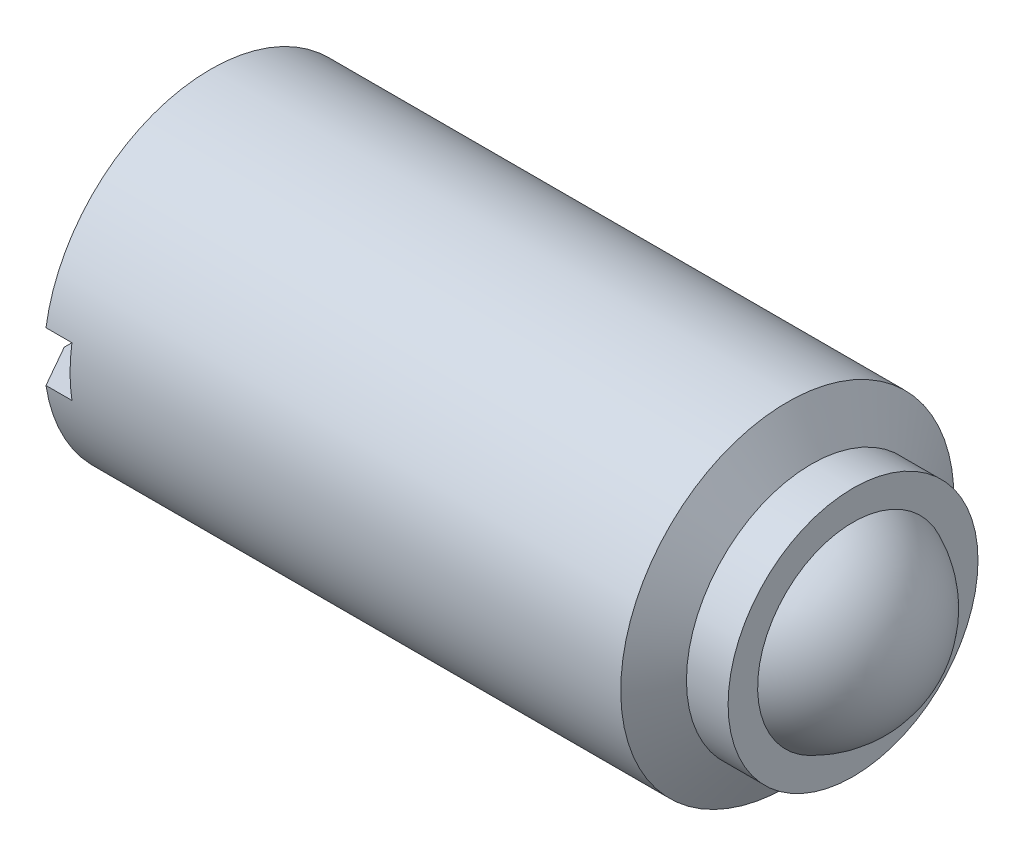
from build123d import *

# Parameters (mm, degrees)
ENL_V_MAT_EXTRU_1_DEPTH      = 19.391574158
ENL_V_MAT_EXTRU_1_DEPTH_BACK = 19.391574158
ESQUISSE2_W                  = 1.2
ESQUISSE2_H                  = 1.2


with BuildPart() as part:
    # Esquisse1 → R_volution1 (revolve)
    with BuildSketch(Plane.XY, mode=Mode.PRIVATE) as r_volution1_sk:
        with BuildLine():
            Line((0, 0), (0, 3))
            Line((0, 3), (0.577350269, 4))
            Line((0.577350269, 4), (14.422649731, 4))
            Line((14.422649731, 4), (15, 3))
            Line((15, 3), (16, 3))
            Line((16, 3), (16, 2.291287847))
            ThreePointArc((16, 2.291287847), (17.091650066, 1.369306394), (17.5, 0))
            Line((17.5, 0), (0, 0))
        make_face()
    revolve(r_volution1_sk.sketch.rotate(Axis((-23.954989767, 0, 0), (1, 0, 0)), 180), axis=Axis((-23.954989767, 0, 0), (1, 0, 0)))

    # Esquisse2 → Enl_v. mat.-Extru.1 (cut, two sides: drawn at the far end of the back side and taken through both)
    with BuildSketch(Plane.XY.offset(-ENL_V_MAT_EXTRU_1_DEPTH_BACK)):
        with Locations((0.6, 0)):
            Rectangle(ESQUISSE2_W, ESQUISSE2_H)
    extrude(amount=ENL_V_MAT_EXTRU_1_DEPTH + ENL_V_MAT_EXTRU_1_DEPTH_BACK, mode=Mode.SUBTRACT)


solid = part.part
